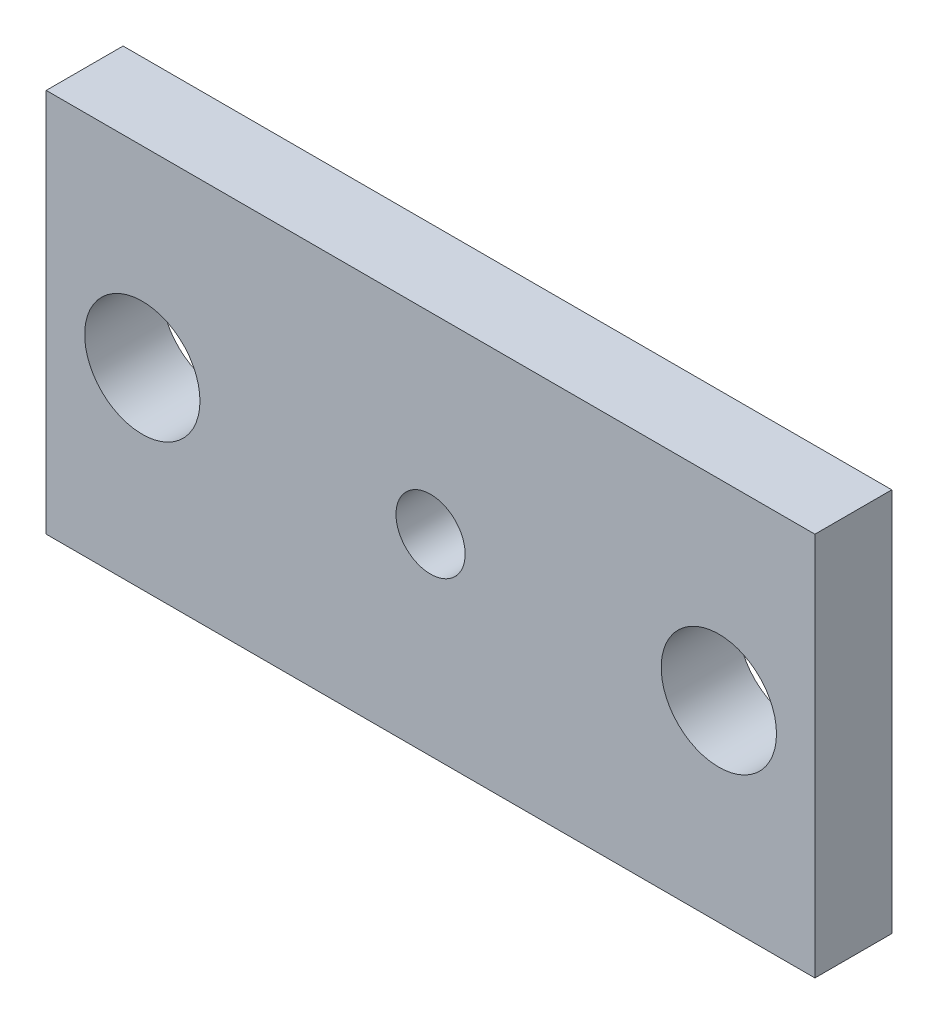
from build123d import *

# Parameters (mm, degrees)
SKETCH1_W           = 25.4
SKETCH1_H           = 12.7
SKETCH1_R           = 1.905
SKETCH1_R_2         = 1.143
BOSS_EXTRUDE1_DEPTH = 2.54


with BuildPart() as part:
    # Sketch1 → Boss-Extrude1 (new body)
    with BuildSketch(Plane(origin=(0, 0, -6.35), x_dir=(-1, 0, 0), z_dir=(0, 0, -1))):
        with Locations((-12.7, 6.35)):
            Rectangle(SKETCH1_W, SKETCH1_H)
        with Locations(Location((-22.225, 6.35, 0), (0, 0, 180))):
            Circle(SKETCH1_R, mode=Mode.SUBTRACT)
        with Locations(Location((-3.175, 6.35, 0), (0, 0, 180))):
            Circle(SKETCH1_R, mode=Mode.SUBTRACT)
        with Locations(Location((-12.7, 6.35, 0), (0, 0, 180))):
            Circle(SKETCH1_R_2, mode=Mode.SUBTRACT)
    extrude(amount=-BOSS_EXTRUDE1_DEPTH)


solid = part.part
